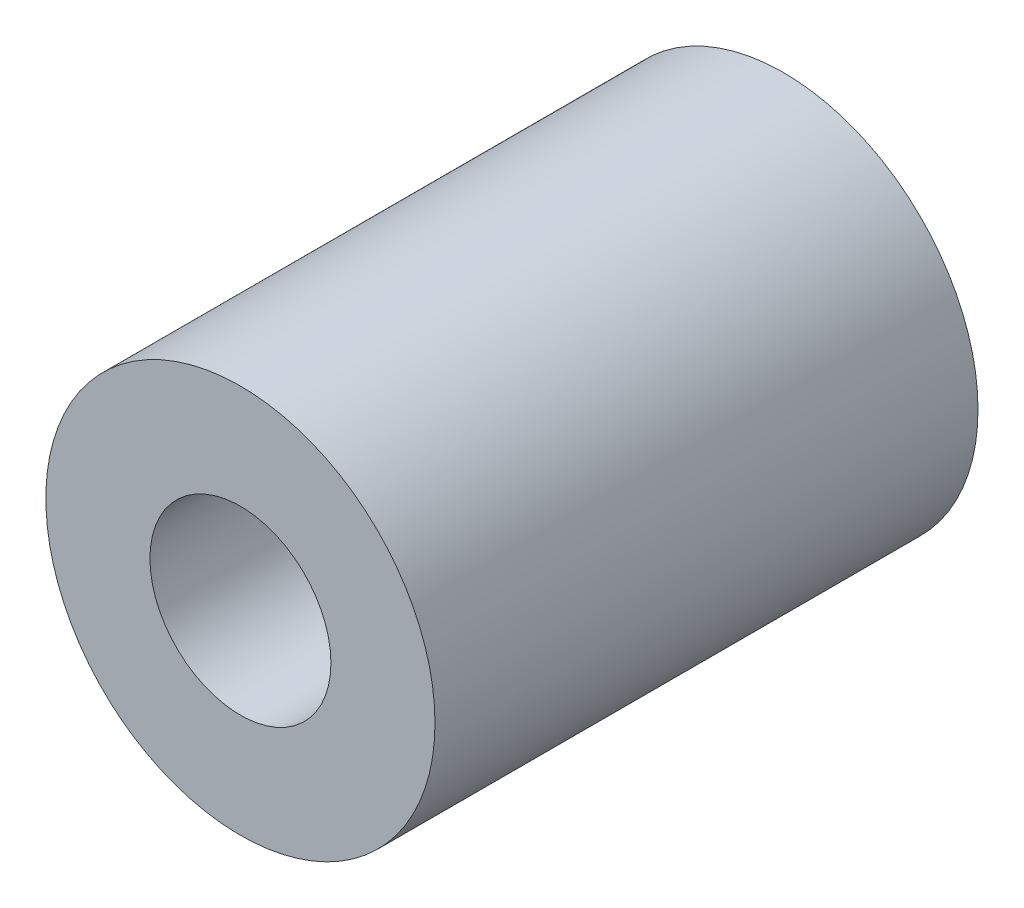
from build123d import *

# Parameters (mm, degrees)
ESQUISSE1_R      = 2.15
ESQUISSE1_R_2    = 1
EXTRUSION1_DEPTH = 6


with BuildPart() as part:
    # Esquisse1 → Extrusion1 (new body)
    with BuildSketch(Plane.XY):
        Circle(ESQUISSE1_R)
        Circle(ESQUISSE1_R_2, mode=Mode.SUBTRACT)
    extrude(amount=EXTRUSION1_DEPTH)


solid = part.part
